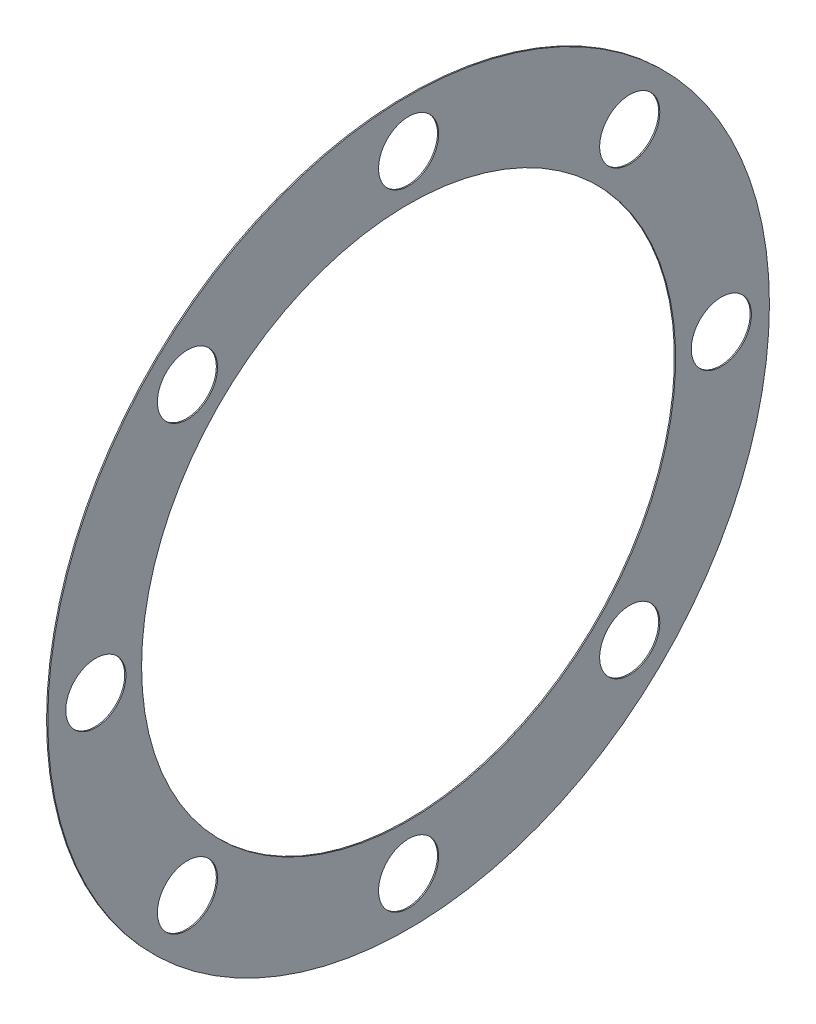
ISO-10303-21;
HEADER;
FILE_DESCRIPTION(('STEP AP214'),'2;1');
FILE_NAME('part.step','',(''),(''),'','','');
FILE_SCHEMA(('AUTOMOTIVE_DESIGN { 1 0 10303 214 1 1 1 1 }'));
ENDSEC;
DATA;
#1=APPLICATION_CONTEXT('core data for automotive mechanical design processes');
#2=APPLICATION_PROTOCOL_DEFINITION('international standard','automotive_design',2000,#1);
#3=PRODUCT_CONTEXT('',#1,'mechanical');
#4=PRODUCT('Part','Part','',(#3));
#5=PRODUCT_RELATED_PRODUCT_CATEGORY('part','',(#4));
#6=PRODUCT_DEFINITION_FORMATION('','',#4);
#7=PRODUCT_DEFINITION_CONTEXT('part definition',#1,'design');
#8=PRODUCT_DEFINITION('design','',#6,#7);
#9=PRODUCT_DEFINITION_SHAPE('','',#8);
#10=(LENGTH_UNIT() NAMED_UNIT(*) SI_UNIT(.MILLI.,.METRE.));
#11=(NAMED_UNIT(*) PLANE_ANGLE_UNIT() SI_UNIT($,.RADIAN.));
#12=(NAMED_UNIT(*) SI_UNIT($,.STERADIAN.) SOLID_ANGLE_UNIT());
#13=UNCERTAINTY_MEASURE_WITH_UNIT(LENGTH_MEASURE(1.E-05),#10,'distance_accuracy_value','');
#14=(GEOMETRIC_REPRESENTATION_CONTEXT(3) GLOBAL_UNCERTAINTY_ASSIGNED_CONTEXT((#13)) GLOBAL_UNIT_ASSIGNED_CONTEXT((#10,
#11,#12)) REPRESENTATION_CONTEXT('',''));
#15=CARTESIAN_POINT('',(0.,0.,0.));
#16=DIRECTION('',(0.,0.,1.));
#17=DIRECTION('',(1.,0.,0.));
#18=AXIS2_PLACEMENT_3D('',#15,#16,#17);
#19=CARTESIAN_POINT('',(0.,75.,0.));
#20=DIRECTION('',(1.,0.,0.));
#21=DIRECTION('',(0.,0.,-1.));
#22=AXIS2_PLACEMENT_3D('',#19,#20,#21);
#23=PLANE('',#22);
#24=CARTESIAN_POINT('',(0.,45.9619407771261,45.961940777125));
#25=DIRECTION('',(1.,0.,0.));
#26=DIRECTION('',(0.,0.,-1.));
#27=AXIS2_PLACEMENT_3D('',#24,#25,#26);
#28=CIRCLE('',#27,6.25);
#29=CARTESIAN_POINT('',(0.,45.9619407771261,39.711940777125));
#30=VERTEX_POINT('',#29);
#31=EDGE_CURVE('E90',#30,#30,#28,.T.);
#32=ORIENTED_EDGE('',*,*,#31,.T.);
#33=EDGE_LOOP('',(#32));
#34=FACE_BOUND('',#33,.T.);
#35=CARTESIAN_POINT('',(0.,-9.56175764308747E-13,64.9999999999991));
#36=DIRECTION('',(1.,0.,0.));
#37=DIRECTION('',(0.,0.,-1.));
#38=AXIS2_PLACEMENT_3D('',#35,#36,#37);
#39=CIRCLE('',#38,6.25000000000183);
#40=CARTESIAN_POINT('',(0.,-9.56175764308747E-13,58.7499999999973));
#41=VERTEX_POINT('',#40);
#42=EDGE_CURVE('E84',#41,#41,#39,.T.);
#43=ORIENTED_EDGE('',*,*,#42,.T.);
#44=EDGE_LOOP('',(#43));
#45=FACE_BOUND('',#44,.T.);
#46=CARTESIAN_POINT('',(0.,-45.9619407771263,45.961940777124));
#47=DIRECTION('',(1.,0.,0.));
#48=DIRECTION('',(0.,0.,-1.));
#49=AXIS2_PLACEMENT_3D('',#46,#47,#48);
#50=CIRCLE('',#49,6.25000000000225);
#51=CARTESIAN_POINT('',(0.,-45.9619407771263,39.7119407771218));
#52=VERTEX_POINT('',#51);
#53=EDGE_CURVE('E78',#52,#52,#50,.T.);
#54=ORIENTED_EDGE('',*,*,#53,.T.);
#55=EDGE_LOOP('',(#54));
#56=FACE_BOUND('',#55,.T.);
#57=CARTESIAN_POINT('',(0.,-65.,-1.85447214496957E-12));
#58=DIRECTION('',(1.,0.,0.));
#59=DIRECTION('',(0.,0.,-1.));
#60=AXIS2_PLACEMENT_3D('',#57,#58,#59);
#61=CIRCLE('',#60,6.25000000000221);
#62=CARTESIAN_POINT('',(0.,-65.,-6.25000000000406));
#63=VERTEX_POINT('',#62);
#64=EDGE_CURVE('E72',#63,#63,#61,.T.);
#65=ORIENTED_EDGE('',*,*,#64,.T.);
#66=EDGE_LOOP('',(#65));
#67=FACE_BOUND('',#66,.T.);
#68=CARTESIAN_POINT('',(0.,-45.9619407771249,-45.9619407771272));
#69=DIRECTION('',(1.,0.,0.));
#70=DIRECTION('',(0.,0.,-1.));
#71=AXIS2_PLACEMENT_3D('',#68,#69,#70);
#72=CIRCLE('',#71,6.25000000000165);
#73=CARTESIAN_POINT('',(0.,-45.9619407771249,-52.2119407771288));
#74=VERTEX_POINT('',#73);
#75=EDGE_CURVE('E66',#74,#74,#72,.T.);
#76=ORIENTED_EDGE('',*,*,#75,.T.);
#77=EDGE_LOOP('',(#76));
#78=FACE_BOUND('',#77,.T.);
#79=CARTESIAN_POINT('',(0.,-2.2694641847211E-13,-65.));
#80=DIRECTION('',(1.,0.,0.));
#81=DIRECTION('',(0.,0.,-1.));
#82=AXIS2_PLACEMENT_3D('',#79,#80,#81);
#83=CIRCLE('',#82,6.25);
#84=CARTESIAN_POINT('',(0.,-2.2694641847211E-13,-71.25));
#85=VERTEX_POINT('',#84);
#86=EDGE_CURVE('E60',#85,#85,#83,.T.);
#87=ORIENTED_EDGE('',*,*,#86,.T.);
#88=EDGE_LOOP('',(#87));
#89=FACE_BOUND('',#88,.T.);
#90=CARTESIAN_POINT('',(0.,45.9619407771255,-45.9619407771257));
#91=DIRECTION('',(1.,0.,0.));
#92=DIRECTION('',(0.,0.,-1.));
#93=AXIS2_PLACEMENT_3D('',#90,#91,#92);
#94=CIRCLE('',#93,6.25);
#95=CARTESIAN_POINT('',(0.,45.9619407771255,-52.2119407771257));
#96=VERTEX_POINT('',#95);
#97=EDGE_CURVE('E54',#96,#96,#94,.T.);
#98=ORIENTED_EDGE('',*,*,#97,.T.);
#99=EDGE_LOOP('',(#98));
#100=FACE_BOUND('',#99,.T.);
#101=CARTESIAN_POINT('',(0.,65.,0.));
#102=DIRECTION('',(1.,0.,0.));
#103=DIRECTION('',(0.,0.,-1.));
#104=AXIS2_PLACEMENT_3D('',#101,#102,#103);
#105=CIRCLE('',#104,6.25);
#106=CARTESIAN_POINT('',(0.,65.,-6.25));
#107=VERTEX_POINT('',#106);
#108=EDGE_CURVE('E48',#107,#107,#105,.T.);
#109=ORIENTED_EDGE('',*,*,#108,.T.);
#110=EDGE_LOOP('',(#109));
#111=FACE_BOUND('',#110,.T.);
#112=CARTESIAN_POINT('',(0.,0.,0.));
#113=DIRECTION('',(-1.,0.,0.));
#114=DIRECTION('',(0.,0.,1.));
#115=AXIS2_PLACEMENT_3D('',#112,#113,#114);
#116=CIRCLE('',#115,55.5);
#117=CARTESIAN_POINT('',(0.,0.,55.5));
#118=VERTEX_POINT('',#117);
#119=EDGE_CURVE('E10',#118,#118,#116,.T.);
#120=ORIENTED_EDGE('',*,*,#119,.F.);
#121=EDGE_LOOP('',(#120));
#122=FACE_BOUND('',#121,.T.);
#123=CARTESIAN_POINT('',(0.,0.,0.));
#124=DIRECTION('',(-1.,0.,0.));
#125=DIRECTION('',(0.,0.,1.));
#126=AXIS2_PLACEMENT_3D('',#123,#124,#125);
#127=CIRCLE('',#126,75.);
#128=CARTESIAN_POINT('',(0.,0.,75.));
#129=VERTEX_POINT('',#128);
#130=EDGE_CURVE('E43',#129,#129,#127,.T.);
#131=ORIENTED_EDGE('',*,*,#130,.T.);
#132=EDGE_LOOP('',(#131));
#133=FACE_BOUND('',#132,.T.);
#134=ADVANCED_FACE('F29',(#34,#45,#56,#67,#78,#89,#100,#111,#122,#133),#23,.F.);
#135=CARTESIAN_POINT('',(0.,0.,0.));
#136=DIRECTION('',(-1.,0.,0.));
#137=DIRECTION('',(0.,0.,1.));
#138=AXIS2_PLACEMENT_3D('',#135,#136,#137);
#139=CYLINDRICAL_SURFACE('',#138,55.5);
#140=CARTESIAN_POINT('',(0.250000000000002,0.,0.));
#141=DIRECTION('',(-1.,0.,0.));
#142=DIRECTION('',(0.,0.,1.));
#143=AXIS2_PLACEMENT_3D('',#140,#141,#142);
#144=CIRCLE('',#143,55.5);
#145=CARTESIAN_POINT('',(0.250000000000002,0.,55.5));
#146=VERTEX_POINT('',#145);
#147=EDGE_CURVE('E35',#146,#146,#144,.T.);
#148=ORIENTED_EDGE('',*,*,#147,.F.);
#149=EDGE_LOOP('',(#148));
#150=FACE_BOUND('',#149,.T.);
#151=ORIENTED_EDGE('',*,*,#119,.T.);
#152=EDGE_LOOP('',(#151));
#153=FACE_BOUND('',#152,.T.);
#154=ADVANCED_FACE('F103',(#150,#153),#139,.F.);
#155=CARTESIAN_POINT('',(0.25,75.,0.));
#156=DIRECTION('',(-1.,0.,0.));
#157=DIRECTION('',(0.,0.,1.));
#158=AXIS2_PLACEMENT_3D('',#155,#156,#157);
#159=PLANE('',#158);
#160=CARTESIAN_POINT('',(0.25,45.9619407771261,45.961940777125));
#161=DIRECTION('',(1.,0.,0.));
#162=DIRECTION('',(0.,0.,-1.));
#163=AXIS2_PLACEMENT_3D('',#160,#161,#162);
#164=CIRCLE('',#163,6.25);
#165=CARTESIAN_POINT('',(0.25,45.9619407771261,39.711940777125));
#166=VERTEX_POINT('',#165);
#167=EDGE_CURVE('E93',#166,#166,#164,.T.);
#168=ORIENTED_EDGE('',*,*,#167,.F.);
#169=EDGE_LOOP('',(#168));
#170=FACE_BOUND('',#169,.T.);
#171=CARTESIAN_POINT('',(0.25,-9.56175764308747E-13,64.9999999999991));
#172=DIRECTION('',(1.,0.,0.));
#173=DIRECTION('',(0.,0.,-1.));
#174=AXIS2_PLACEMENT_3D('',#171,#172,#173);
#175=CIRCLE('',#174,6.25000000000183);
#176=CARTESIAN_POINT('',(0.25,-9.56175764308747E-13,58.7499999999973));
#177=VERTEX_POINT('',#176);
#178=EDGE_CURVE('E87',#177,#177,#175,.T.);
#179=ORIENTED_EDGE('',*,*,#178,.F.);
#180=EDGE_LOOP('',(#179));
#181=FACE_BOUND('',#180,.T.);
#182=CARTESIAN_POINT('',(0.25,-45.9619407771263,45.961940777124));
#183=DIRECTION('',(1.,0.,0.));
#184=DIRECTION('',(0.,0.,-1.));
#185=AXIS2_PLACEMENT_3D('',#182,#183,#184);
#186=CIRCLE('',#185,6.25000000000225);
#187=CARTESIAN_POINT('',(0.25,-45.9619407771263,39.7119407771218));
#188=VERTEX_POINT('',#187);
#189=EDGE_CURVE('E81',#188,#188,#186,.T.);
#190=ORIENTED_EDGE('',*,*,#189,.F.);
#191=EDGE_LOOP('',(#190));
#192=FACE_BOUND('',#191,.T.);
#193=CARTESIAN_POINT('',(0.25,-65.,-1.85447214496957E-12));
#194=DIRECTION('',(1.,0.,0.));
#195=DIRECTION('',(0.,0.,-1.));
#196=AXIS2_PLACEMENT_3D('',#193,#194,#195);
#197=CIRCLE('',#196,6.25000000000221);
#198=CARTESIAN_POINT('',(0.25,-65.,-6.25000000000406));
#199=VERTEX_POINT('',#198);
#200=EDGE_CURVE('E75',#199,#199,#197,.T.);
#201=ORIENTED_EDGE('',*,*,#200,.F.);
#202=EDGE_LOOP('',(#201));
#203=FACE_BOUND('',#202,.T.);
#204=CARTESIAN_POINT('',(0.25,-45.9619407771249,-45.9619407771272));
#205=DIRECTION('',(1.,0.,0.));
#206=DIRECTION('',(0.,0.,-1.));
#207=AXIS2_PLACEMENT_3D('',#204,#205,#206);
#208=CIRCLE('',#207,6.25000000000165);
#209=CARTESIAN_POINT('',(0.25,-45.9619407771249,-52.2119407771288));
#210=VERTEX_POINT('',#209);
#211=EDGE_CURVE('E69',#210,#210,#208,.T.);
#212=ORIENTED_EDGE('',*,*,#211,.F.);
#213=EDGE_LOOP('',(#212));
#214=FACE_BOUND('',#213,.T.);
#215=CARTESIAN_POINT('',(0.25,-2.2694641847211E-13,-65.));
#216=DIRECTION('',(1.,0.,0.));
#217=DIRECTION('',(0.,0.,-1.));
#218=AXIS2_PLACEMENT_3D('',#215,#216,#217);
#219=CIRCLE('',#218,6.25);
#220=CARTESIAN_POINT('',(0.25,-2.2694641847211E-13,-71.25));
#221=VERTEX_POINT('',#220);
#222=EDGE_CURVE('E63',#221,#221,#219,.T.);
#223=ORIENTED_EDGE('',*,*,#222,.F.);
#224=EDGE_LOOP('',(#223));
#225=FACE_BOUND('',#224,.T.);
#226=CARTESIAN_POINT('',(0.25,45.9619407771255,-45.9619407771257));
#227=DIRECTION('',(1.,0.,0.));
#228=DIRECTION('',(0.,0.,-1.));
#229=AXIS2_PLACEMENT_3D('',#226,#227,#228);
#230=CIRCLE('',#229,6.25);
#231=CARTESIAN_POINT('',(0.25,45.9619407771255,-52.2119407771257));
#232=VERTEX_POINT('',#231);
#233=EDGE_CURVE('E57',#232,#232,#230,.T.);
#234=ORIENTED_EDGE('',*,*,#233,.F.);
#235=EDGE_LOOP('',(#234));
#236=FACE_BOUND('',#235,.T.);
#237=CARTESIAN_POINT('',(0.25,65.,0.));
#238=DIRECTION('',(1.,0.,0.));
#239=DIRECTION('',(0.,0.,-1.));
#240=AXIS2_PLACEMENT_3D('',#237,#238,#239);
#241=CIRCLE('',#240,6.25);
#242=CARTESIAN_POINT('',(0.25,65.,-6.25));
#243=VERTEX_POINT('',#242);
#244=EDGE_CURVE('E51',#243,#243,#241,.T.);
#245=ORIENTED_EDGE('',*,*,#244,.F.);
#246=EDGE_LOOP('',(#245));
#247=FACE_BOUND('',#246,.T.);
#248=CARTESIAN_POINT('',(0.249999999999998,0.,0.));
#249=DIRECTION('',(-1.,0.,0.));
#250=DIRECTION('',(0.,0.,1.));
#251=AXIS2_PLACEMENT_3D('',#248,#249,#250);
#252=CIRCLE('',#251,75.);
#253=CARTESIAN_POINT('',(0.249999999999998,0.,75.));
#254=VERTEX_POINT('',#253);
#255=EDGE_CURVE('E39',#254,#254,#252,.T.);
#256=ORIENTED_EDGE('',*,*,#255,.F.);
#257=EDGE_LOOP('',(#256));
#258=FACE_BOUND('',#257,.T.);
#259=ORIENTED_EDGE('',*,*,#147,.T.);
#260=EDGE_LOOP('',(#259));
#261=FACE_BOUND('',#260,.T.);
#262=ADVANCED_FACE('F99',(#170,#181,#192,#203,#214,#225,#236,#247,#258,#261),#159,.F.);
#263=CARTESIAN_POINT('',(0.,0.,0.));
#264=DIRECTION('',(-1.,0.,0.));
#265=DIRECTION('',(0.,0.,1.));
#266=AXIS2_PLACEMENT_3D('',#263,#264,#265);
#267=CYLINDRICAL_SURFACE('',#266,75.);
#268=ORIENTED_EDGE('',*,*,#130,.F.);
#269=EDGE_LOOP('',(#268));
#270=FACE_BOUND('',#269,.T.);
#271=ORIENTED_EDGE('',*,*,#255,.T.);
#272=EDGE_LOOP('',(#271));
#273=FACE_BOUND('',#272,.T.);
#274=ADVANCED_FACE('F102',(#270,#273),#267,.T.);
#275=CARTESIAN_POINT('',(0.,65.,0.));
#276=DIRECTION('',(1.,0.,0.));
#277=DIRECTION('',(0.,0.,-1.));
#278=AXIS2_PLACEMENT_3D('',#275,#276,#277);
#279=CYLINDRICAL_SURFACE('',#278,6.25);
#280=ORIENTED_EDGE('',*,*,#108,.F.);
#281=EDGE_LOOP('',(#280));
#282=FACE_BOUND('',#281,.T.);
#283=ORIENTED_EDGE('',*,*,#244,.T.);
#284=EDGE_LOOP('',(#283));
#285=FACE_BOUND('',#284,.T.);
#286=ADVANCED_FACE('F122',(#282,#285),#279,.F.);
#287=CARTESIAN_POINT('',(0.,45.9619407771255,-45.9619407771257));
#288=DIRECTION('',(1.,0.,0.));
#289=DIRECTION('',(0.,0.,-1.));
#290=AXIS2_PLACEMENT_3D('',#287,#288,#289);
#291=CYLINDRICAL_SURFACE('',#290,6.25);
#292=ORIENTED_EDGE('',*,*,#97,.F.);
#293=EDGE_LOOP('',(#292));
#294=FACE_BOUND('',#293,.T.);
#295=ORIENTED_EDGE('',*,*,#233,.T.);
#296=EDGE_LOOP('',(#295));
#297=FACE_BOUND('',#296,.T.);
#298=ADVANCED_FACE('F128',(#294,#297),#291,.F.);
#299=CARTESIAN_POINT('',(0.,-2.2694641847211E-13,-65.));
#300=DIRECTION('',(1.,0.,0.));
#301=DIRECTION('',(0.,0.,-1.));
#302=AXIS2_PLACEMENT_3D('',#299,#300,#301);
#303=CYLINDRICAL_SURFACE('',#302,6.25);
#304=ORIENTED_EDGE('',*,*,#86,.F.);
#305=EDGE_LOOP('',(#304));
#306=FACE_BOUND('',#305,.T.);
#307=ORIENTED_EDGE('',*,*,#222,.T.);
#308=EDGE_LOOP('',(#307));
#309=FACE_BOUND('',#308,.T.);
#310=ADVANCED_FACE('F159',(#306,#309),#303,.F.);
#311=CARTESIAN_POINT('',(0.,-45.9619407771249,-45.9619407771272));
#312=DIRECTION('',(1.,0.,0.));
#313=DIRECTION('',(0.,0.,-1.));
#314=AXIS2_PLACEMENT_3D('',#311,#312,#313);
#315=CYLINDRICAL_SURFACE('',#314,6.25000000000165);
#316=ORIENTED_EDGE('',*,*,#75,.F.);
#317=EDGE_LOOP('',(#316));
#318=FACE_BOUND('',#317,.T.);
#319=ORIENTED_EDGE('',*,*,#211,.T.);
#320=EDGE_LOOP('',(#319));
#321=FACE_BOUND('',#320,.T.);
#322=ADVANCED_FACE('F164',(#318,#321),#315,.F.);
#323=CARTESIAN_POINT('',(0.,-65.,-1.85447214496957E-12));
#324=DIRECTION('',(1.,0.,0.));
#325=DIRECTION('',(0.,0.,-1.));
#326=AXIS2_PLACEMENT_3D('',#323,#324,#325);
#327=CYLINDRICAL_SURFACE('',#326,6.25000000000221);
#328=ORIENTED_EDGE('',*,*,#64,.F.);
#329=EDGE_LOOP('',(#328));
#330=FACE_BOUND('',#329,.T.);
#331=ORIENTED_EDGE('',*,*,#200,.T.);
#332=EDGE_LOOP('',(#331));
#333=FACE_BOUND('',#332,.T.);
#334=ADVANCED_FACE('F170',(#330,#333),#327,.F.);
#335=CARTESIAN_POINT('',(0.,-45.9619407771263,45.961940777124));
#336=DIRECTION('',(1.,0.,0.));
#337=DIRECTION('',(0.,0.,-1.));
#338=AXIS2_PLACEMENT_3D('',#335,#336,#337);
#339=CYLINDRICAL_SURFACE('',#338,6.25000000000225);
#340=ORIENTED_EDGE('',*,*,#53,.F.);
#341=EDGE_LOOP('',(#340));
#342=FACE_BOUND('',#341,.T.);
#343=ORIENTED_EDGE('',*,*,#189,.T.);
#344=EDGE_LOOP('',(#343));
#345=FACE_BOUND('',#344,.T.);
#346=ADVANCED_FACE('F174',(#342,#345),#339,.F.);
#347=CARTESIAN_POINT('',(0.,-9.56175764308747E-13,64.9999999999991));
#348=DIRECTION('',(1.,0.,0.));
#349=DIRECTION('',(0.,0.,-1.));
#350=AXIS2_PLACEMENT_3D('',#347,#348,#349);
#351=CYLINDRICAL_SURFACE('',#350,6.25000000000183);
#352=ORIENTED_EDGE('',*,*,#42,.F.);
#353=EDGE_LOOP('',(#352));
#354=FACE_BOUND('',#353,.T.);
#355=ORIENTED_EDGE('',*,*,#178,.T.);
#356=EDGE_LOOP('',(#355));
#357=FACE_BOUND('',#356,.T.);
#358=ADVANCED_FACE('F178',(#354,#357),#351,.F.);
#359=CARTESIAN_POINT('',(0.,45.9619407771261,45.961940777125));
#360=DIRECTION('',(1.,0.,0.));
#361=DIRECTION('',(0.,0.,-1.));
#362=AXIS2_PLACEMENT_3D('',#359,#360,#361);
#363=CYLINDRICAL_SURFACE('',#362,6.25);
#364=ORIENTED_EDGE('',*,*,#31,.F.);
#365=EDGE_LOOP('',(#364));
#366=FACE_BOUND('',#365,.T.);
#367=ORIENTED_EDGE('',*,*,#167,.T.);
#368=EDGE_LOOP('',(#367));
#369=FACE_BOUND('',#368,.T.);
#370=ADVANCED_FACE('F97',(#366,#369),#363,.F.);
#371=CLOSED_SHELL('',(#134,#154,#262,#274,#286,#298,#310,#322,#334,#346,#358,#370));
#372=MANIFOLD_SOLID_BREP('B2',#371);
#373=ADVANCED_BREP_SHAPE_REPRESENTATION('',(#18,#372),#14);
#374=SHAPE_DEFINITION_REPRESENTATION(#9,#373);
ENDSEC;
END-ISO-10303-21;
